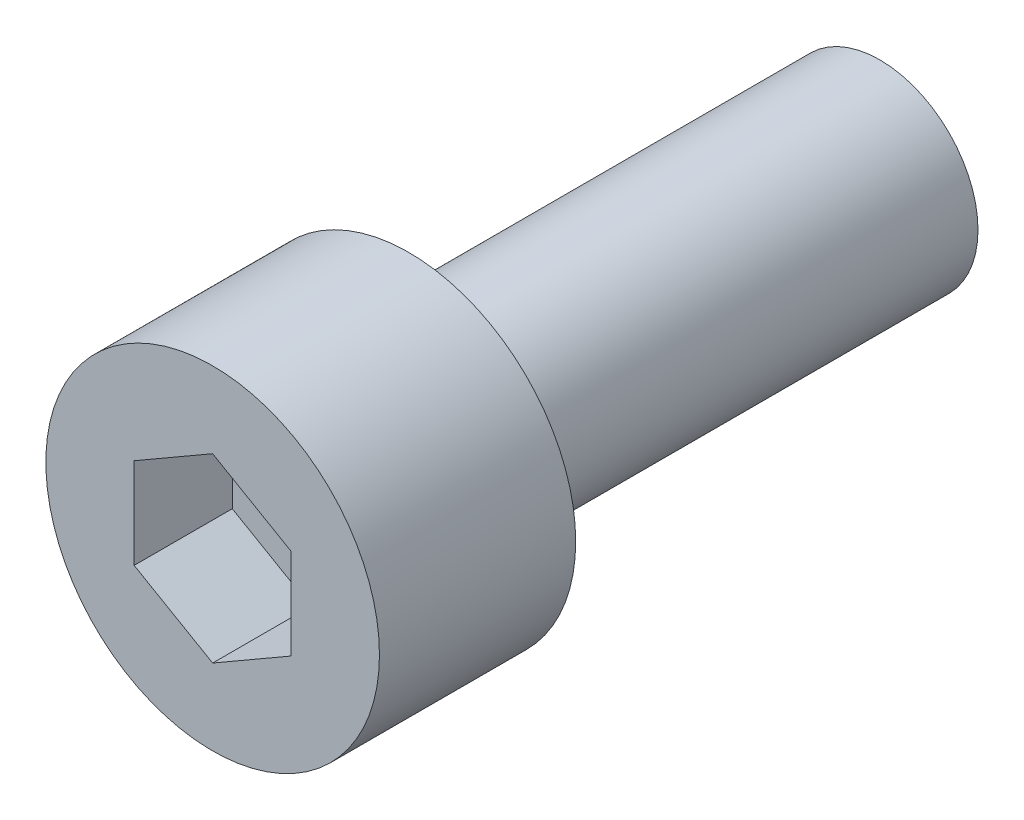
ISO-10303-21;
HEADER;
FILE_DESCRIPTION(('STEP AP214'),'2;1');
FILE_NAME('part.step','',(''),(''),'','','');
FILE_SCHEMA(('AUTOMOTIVE_DESIGN { 1 0 10303 214 1 1 1 1 }'));
ENDSEC;
DATA;
#1=APPLICATION_CONTEXT('core data for automotive mechanical design processes');
#2=APPLICATION_PROTOCOL_DEFINITION('international standard','automotive_design',2000,#1);
#3=PRODUCT_CONTEXT('',#1,'mechanical');
#4=PRODUCT('Part','Part','',(#3));
#5=PRODUCT_RELATED_PRODUCT_CATEGORY('part','',(#4));
#6=PRODUCT_DEFINITION_FORMATION('','',#4);
#7=PRODUCT_DEFINITION_CONTEXT('part definition',#1,'design');
#8=PRODUCT_DEFINITION('design','',#6,#7);
#9=PRODUCT_DEFINITION_SHAPE('','',#8);
#10=(LENGTH_UNIT() NAMED_UNIT(*) SI_UNIT(.MILLI.,.METRE.));
#11=(NAMED_UNIT(*) PLANE_ANGLE_UNIT() SI_UNIT($,.RADIAN.));
#12=(NAMED_UNIT(*) SI_UNIT($,.STERADIAN.) SOLID_ANGLE_UNIT());
#13=UNCERTAINTY_MEASURE_WITH_UNIT(LENGTH_MEASURE(1.E-05),#10,'distance_accuracy_value','');
#14=(GEOMETRIC_REPRESENTATION_CONTEXT(3) GLOBAL_UNCERTAINTY_ASSIGNED_CONTEXT((#13)) GLOBAL_UNIT_ASSIGNED_CONTEXT((#10,
#11,#12)) REPRESENTATION_CONTEXT('',''));
#15=CARTESIAN_POINT('',(0.,0.,0.));
#16=DIRECTION('',(0.,0.,1.));
#17=DIRECTION('',(1.,0.,0.));
#18=AXIS2_PLACEMENT_3D('',#15,#16,#17);
#19=CARTESIAN_POINT('',(2.5,0.,-12.));
#20=DIRECTION('',(0.,0.,-1.));
#21=DIRECTION('',(-1.,0.,0.));
#22=AXIS2_PLACEMENT_3D('',#19,#20,#21);
#23=PLANE('',#22);
#24=CARTESIAN_POINT('',(0.,0.,-12.));
#25=DIRECTION('',(0.,0.,-1.));
#26=DIRECTION('',(-1.,0.,0.));
#27=AXIS2_PLACEMENT_3D('',#24,#25,#26);
#28=CIRCLE('',#27,2.5);
#29=CARTESIAN_POINT('',(-2.5,0.,-12.));
#30=VERTEX_POINT('',#29);
#31=EDGE_CURVE('E11',#30,#30,#28,.T.);
#32=ORIENTED_EDGE('',*,*,#31,.T.);
#33=EDGE_LOOP('',(#32));
#34=FACE_BOUND('',#33,.T.);
#35=ADVANCED_FACE('F17',(#34),#23,.T.);
#36=CARTESIAN_POINT('',(0.,2.3094010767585,2.5));
#37=DIRECTION('',(-0.5,-0.86602540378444,0.));
#38=DIRECTION('',(0.86602540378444,-0.5,0.));
#39=AXIS2_PLACEMENT_3D('',#36,#37,#38);
#40=PLANE('',#39);
#41=DIRECTION('',(0.,0.,1.));
#42=VECTOR('',#41,1.);
#43=CARTESIAN_POINT('',(2.,1.15470053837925,2.5));
#44=LINE('',#43,#42);
#45=CARTESIAN_POINT('',(2.,1.15470053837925,2.5));
#46=VERTEX_POINT('',#45);
#47=CARTESIAN_POINT('',(2.,1.15470053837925,5.));
#48=VERTEX_POINT('',#47);
#49=EDGE_CURVE('E66',#46,#48,#44,.T.);
#50=ORIENTED_EDGE('',*,*,#49,.T.);
#51=DIRECTION('',(0.86602540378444,-0.5,0.));
#52=VECTOR('',#51,1.);
#53=CARTESIAN_POINT('',(0.,2.3094010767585,5.));
#54=LINE('',#53,#52);
#55=CARTESIAN_POINT('',(0.,2.3094010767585,5.));
#56=VERTEX_POINT('',#55);
#57=EDGE_CURVE('E32',#56,#48,#54,.T.);
#58=ORIENTED_EDGE('',*,*,#57,.F.);
#59=DIRECTION('',(0.,0.,1.));
#60=VECTOR('',#59,1.);
#61=CARTESIAN_POINT('',(0.,2.3094010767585,2.5));
#62=LINE('',#61,#60);
#63=CARTESIAN_POINT('',(0.,2.3094010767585,2.5));
#64=VERTEX_POINT('',#63);
#65=EDGE_CURVE('E36',#64,#56,#62,.T.);
#66=ORIENTED_EDGE('',*,*,#65,.F.);
#67=DIRECTION('',(0.86602540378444,-0.5,0.));
#68=VECTOR('',#67,1.);
#69=CARTESIAN_POINT('',(0.,2.3094010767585,2.5));
#70=LINE('',#69,#68);
#71=EDGE_CURVE('E69',#64,#46,#70,.T.);
#72=ORIENTED_EDGE('',*,*,#71,.T.);
#73=EDGE_LOOP('',(#50,#58,#66,#72));
#74=FACE_BOUND('',#73,.T.);
#75=ADVANCED_FACE('F68',(#74),#40,.T.);
#76=CARTESIAN_POINT('',(2.,-1.15470053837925,2.5));
#77=DIRECTION('',(1.,0.,0.));
#78=DIRECTION('',(0.,0.,-1.));
#79=AXIS2_PLACEMENT_3D('',#76,#77,#78);
#80=PLANE('',#79);
#81=DIRECTION('',(0.,0.,1.));
#82=VECTOR('',#81,1.);
#83=CARTESIAN_POINT('',(2.,-1.15470053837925,2.5));
#84=LINE('',#83,#82);
#85=CARTESIAN_POINT('',(2.,-1.15470053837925,2.5));
#86=VERTEX_POINT('',#85);
#87=CARTESIAN_POINT('',(2.,-1.15470053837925,5.));
#88=VERTEX_POINT('',#87);
#89=EDGE_CURVE('E74',#86,#88,#84,.T.);
#90=ORIENTED_EDGE('',*,*,#89,.T.);
#91=DIRECTION('',(0.,1.,0.));
#92=VECTOR('',#91,1.);
#93=CARTESIAN_POINT('',(2.,-1.15470053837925,5.));
#94=LINE('',#93,#92);
#95=EDGE_CURVE('E77',#88,#48,#94,.T.);
#96=ORIENTED_EDGE('',*,*,#95,.T.);
#97=ORIENTED_EDGE('',*,*,#49,.F.);
#98=DIRECTION('',(0.,1.,0.));
#99=VECTOR('',#98,1.);
#100=CARTESIAN_POINT('',(2.,-1.15470053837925,2.5));
#101=LINE('',#100,#99);
#102=EDGE_CURVE('E104',#86,#46,#101,.T.);
#103=ORIENTED_EDGE('',*,*,#102,.F.);
#104=EDGE_LOOP('',(#90,#96,#97,#103));
#105=FACE_BOUND('',#104,.T.);
#106=ADVANCED_FACE('F78',(#105),#80,.F.);
#107=CARTESIAN_POINT('',(0.,-2.3094010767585,2.5));
#108=DIRECTION('',(0.5,-0.86602540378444,0.));
#109=DIRECTION('',(0.86602540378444,0.5,0.));
#110=AXIS2_PLACEMENT_3D('',#107,#108,#109);
#111=PLANE('',#110);
#112=DIRECTION('',(0.,0.,1.));
#113=VECTOR('',#112,1.);
#114=CARTESIAN_POINT('',(0.,-2.3094010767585,2.5));
#115=LINE('',#114,#113);
#116=CARTESIAN_POINT('',(0.,-2.3094010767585,2.5));
#117=VERTEX_POINT('',#116);
#118=CARTESIAN_POINT('',(0.,-2.3094010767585,5.));
#119=VERTEX_POINT('',#118);
#120=EDGE_CURVE('E112',#117,#119,#115,.T.);
#121=ORIENTED_EDGE('',*,*,#120,.T.);
#122=DIRECTION('',(0.86602540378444,0.5,0.));
#123=VECTOR('',#122,1.);
#124=CARTESIAN_POINT('',(0.,-2.3094010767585,5.));
#125=LINE('',#124,#123);
#126=EDGE_CURVE('E82',#119,#88,#125,.T.);
#127=ORIENTED_EDGE('',*,*,#126,.T.);
#128=ORIENTED_EDGE('',*,*,#89,.F.);
#129=DIRECTION('',(0.86602540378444,0.5,0.));
#130=VECTOR('',#129,1.);
#131=CARTESIAN_POINT('',(0.,-2.3094010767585,2.5));
#132=LINE('',#131,#130);
#133=EDGE_CURVE('E101',#117,#86,#132,.T.);
#134=ORIENTED_EDGE('',*,*,#133,.F.);
#135=EDGE_LOOP('',(#121,#127,#128,#134));
#136=FACE_BOUND('',#135,.T.);
#137=ADVANCED_FACE('F213',(#136),#111,.F.);
#138=CARTESIAN_POINT('',(0.,-2.3094010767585,2.5));
#139=DIRECTION('',(0.5,0.86602540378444,0.));
#140=DIRECTION('',(-0.86602540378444,0.5,0.));
#141=AXIS2_PLACEMENT_3D('',#138,#139,#140);
#142=PLANE('',#141);
#143=DIRECTION('',(0.,0.,1.));
#144=VECTOR('',#143,1.);
#145=CARTESIAN_POINT('',(-2.,-1.15470053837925,2.5));
#146=LINE('',#145,#144);
#147=CARTESIAN_POINT('',(-2.,-1.15470053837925,2.5));
#148=VERTEX_POINT('',#147);
#149=CARTESIAN_POINT('',(-2.,-1.15470053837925,5.));
#150=VERTEX_POINT('',#149);
#151=EDGE_CURVE('E110',#148,#150,#146,.T.);
#152=ORIENTED_EDGE('',*,*,#151,.T.);
#153=DIRECTION('',(-0.86602540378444,0.5,0.));
#154=VECTOR('',#153,1.);
#155=CARTESIAN_POINT('',(0.,-2.3094010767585,5.));
#156=LINE('',#155,#154);
#157=EDGE_CURVE('E250',#119,#150,#156,.T.);
#158=ORIENTED_EDGE('',*,*,#157,.F.);
#159=ORIENTED_EDGE('',*,*,#120,.F.);
#160=DIRECTION('',(-0.86602540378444,0.5,0.));
#161=VECTOR('',#160,1.);
#162=CARTESIAN_POINT('',(0.,-2.3094010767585,2.5));
#163=LINE('',#162,#161);
#164=EDGE_CURVE('E98',#117,#148,#163,.T.);
#165=ORIENTED_EDGE('',*,*,#164,.T.);
#166=EDGE_LOOP('',(#152,#158,#159,#165));
#167=FACE_BOUND('',#166,.T.);
#168=ADVANCED_FACE('F203',(#167),#142,.T.);
#169=CARTESIAN_POINT('',(-2.,1.15470053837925,2.5));
#170=DIRECTION('',(-1.,0.,0.));
#171=DIRECTION('',(0.,-1.,0.));
#172=AXIS2_PLACEMENT_3D('',#169,#170,#171);
#173=PLANE('',#172);
#174=DIRECTION('',(0.,0.,1.));
#175=VECTOR('',#174,1.);
#176=CARTESIAN_POINT('',(-2.,1.15470053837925,2.5));
#177=LINE('',#176,#175);
#178=CARTESIAN_POINT('',(-2.,1.15470053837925,2.5));
#179=VERTEX_POINT('',#178);
#180=CARTESIAN_POINT('',(-2.,1.15470053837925,5.));
#181=VERTEX_POINT('',#180);
#182=EDGE_CURVE('E108',#179,#181,#177,.T.);
#183=ORIENTED_EDGE('',*,*,#182,.T.);
#184=DIRECTION('',(0.,-1.,0.));
#185=VECTOR('',#184,1.);
#186=CARTESIAN_POINT('',(-2.,1.15470053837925,5.));
#187=LINE('',#186,#185);
#188=EDGE_CURVE('E252',#181,#150,#187,.T.);
#189=ORIENTED_EDGE('',*,*,#188,.T.);
#190=ORIENTED_EDGE('',*,*,#151,.F.);
#191=DIRECTION('',(0.,-1.,0.));
#192=VECTOR('',#191,1.);
#193=CARTESIAN_POINT('',(-2.,1.15470053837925,2.5));
#194=LINE('',#193,#192);
#195=EDGE_CURVE('E95',#179,#148,#194,.T.);
#196=ORIENTED_EDGE('',*,*,#195,.F.);
#197=EDGE_LOOP('',(#183,#189,#190,#196));
#198=FACE_BOUND('',#197,.T.);
#199=ADVANCED_FACE('F186',(#198),#173,.F.);
#200=CARTESIAN_POINT('',(0.,2.3094010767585,2.5));
#201=DIRECTION('',(-0.5,0.86602540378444,0.));
#202=DIRECTION('',(-0.86602540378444,-0.5,0.));
#203=AXIS2_PLACEMENT_3D('',#200,#201,#202);
#204=PLANE('',#203);
#205=DIRECTION('',(-0.86602540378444,-0.5,0.));
#206=VECTOR('',#205,1.);
#207=CARTESIAN_POINT('',(0.,2.3094010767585,2.5));
#208=LINE('',#207,#206);
#209=EDGE_CURVE('E92',#64,#179,#208,.T.);
#210=ORIENTED_EDGE('',*,*,#209,.F.);
#211=ORIENTED_EDGE('',*,*,#65,.T.);
#212=DIRECTION('',(-0.86602540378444,-0.5,0.));
#213=VECTOR('',#212,1.);
#214=CARTESIAN_POINT('',(0.,2.3094010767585,5.));
#215=LINE('',#214,#213);
#216=EDGE_CURVE('E88',#56,#181,#215,.T.);
#217=ORIENTED_EDGE('',*,*,#216,.T.);
#218=ORIENTED_EDGE('',*,*,#182,.F.);
#219=EDGE_LOOP('',(#210,#211,#217,#218));
#220=FACE_BOUND('',#219,.T.);
#221=ADVANCED_FACE('F138',(#220),#204,.F.);
#222=CARTESIAN_POINT('',(-2.,3.46410161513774,2.5));
#223=DIRECTION('',(0.,0.,-1.));
#224=DIRECTION('',(-1.,0.,0.));
#225=AXIS2_PLACEMENT_3D('',#222,#223,#224);
#226=PLANE('',#225);
#227=ORIENTED_EDGE('',*,*,#71,.F.);
#228=ORIENTED_EDGE('',*,*,#209,.T.);
#229=ORIENTED_EDGE('',*,*,#195,.T.);
#230=ORIENTED_EDGE('',*,*,#164,.F.);
#231=ORIENTED_EDGE('',*,*,#133,.T.);
#232=ORIENTED_EDGE('',*,*,#102,.T.);
#233=EDGE_LOOP('',(#227,#228,#229,#230,#231,#232));
#234=FACE_BOUND('',#233,.T.);
#235=ADVANCED_FACE('F136',(#234),#226,.F.);
#236=CARTESIAN_POINT('',(0.,0.,5.));
#237=DIRECTION('',(0.,0.,1.));
#238=DIRECTION('',(1.,0.,0.));
#239=AXIS2_PLACEMENT_3D('',#236,#237,#238);
#240=PLANE('',#239);
#241=CARTESIAN_POINT('',(0.,0.,5.));
#242=DIRECTION('',(0.,0.,1.));
#243=DIRECTION('',(1.,0.,0.));
#244=AXIS2_PLACEMENT_3D('',#241,#242,#243);
#245=CIRCLE('',#244,4.25);
#246=CARTESIAN_POINT('',(4.25,0.,5.));
#247=VERTEX_POINT('',#246);
#248=EDGE_CURVE('E25',#247,#247,#245,.T.);
#249=ORIENTED_EDGE('',*,*,#248,.T.);
#250=EDGE_LOOP('',(#249));
#251=FACE_BOUND('',#250,.T.);
#252=ORIENTED_EDGE('',*,*,#216,.F.);
#253=ORIENTED_EDGE('',*,*,#57,.T.);
#254=ORIENTED_EDGE('',*,*,#95,.F.);
#255=ORIENTED_EDGE('',*,*,#126,.F.);
#256=ORIENTED_EDGE('',*,*,#157,.T.);
#257=ORIENTED_EDGE('',*,*,#188,.F.);
#258=EDGE_LOOP('',(#252,#253,#254,#255,#256,#257));
#259=FACE_BOUND('',#258,.T.);
#260=ADVANCED_FACE('F85',(#251,#259),#240,.T.);
#261=CARTESIAN_POINT('',(0.,0.,8.));
#262=DIRECTION('',(0.,0.,1.));
#263=DIRECTION('',(1.,0.,0.));
#264=AXIS2_PLACEMENT_3D('',#261,#262,#263);
#265=CYLINDRICAL_SURFACE('',#264,4.25);
#266=CARTESIAN_POINT('',(0.,0.,0.));
#267=DIRECTION('',(0.,0.,1.));
#268=DIRECTION('',(1.,0.,0.));
#269=AXIS2_PLACEMENT_3D('',#266,#267,#268);
#270=CIRCLE('',#269,4.25);
#271=CARTESIAN_POINT('',(4.25,0.,0.));
#272=VERTEX_POINT('',#271);
#273=EDGE_CURVE('E117',#272,#272,#270,.T.);
#274=ORIENTED_EDGE('',*,*,#273,.T.);
#275=EDGE_LOOP('',(#274));
#276=FACE_BOUND('',#275,.T.);
#277=ORIENTED_EDGE('',*,*,#248,.F.);
#278=EDGE_LOOP('',(#277));
#279=FACE_BOUND('',#278,.T.);
#280=ADVANCED_FACE('F123',(#276,#279),#265,.T.);
#281=CARTESIAN_POINT('',(4.25,0.,0.));
#282=DIRECTION('',(0.,0.,-1.));
#283=DIRECTION('',(-1.,0.,0.));
#284=AXIS2_PLACEMENT_3D('',#281,#282,#283);
#285=PLANE('',#284);
#286=CARTESIAN_POINT('',(0.,0.,0.));
#287=DIRECTION('',(0.,0.,1.));
#288=DIRECTION('',(1.,0.,0.));
#289=AXIS2_PLACEMENT_3D('',#286,#287,#288);
#290=CIRCLE('',#289,2.5);
#291=CARTESIAN_POINT('',(2.5,0.,0.));
#292=VERTEX_POINT('',#291);
#293=EDGE_CURVE('E73',#292,#292,#290,.T.);
#294=ORIENTED_EDGE('',*,*,#293,.T.);
#295=EDGE_LOOP('',(#294));
#296=FACE_BOUND('',#295,.T.);
#297=ORIENTED_EDGE('',*,*,#273,.F.);
#298=EDGE_LOOP('',(#297));
#299=FACE_BOUND('',#298,.T.);
#300=ADVANCED_FACE('F125',(#296,#299),#285,.T.);
#301=CARTESIAN_POINT('',(0.,0.,8.));
#302=DIRECTION('',(0.,0.,1.));
#303=DIRECTION('',(1.,0.,0.));
#304=AXIS2_PLACEMENT_3D('',#301,#302,#303);
#305=CYLINDRICAL_SURFACE('',#304,2.5);
#306=ORIENTED_EDGE('',*,*,#31,.F.);
#307=EDGE_LOOP('',(#306));
#308=FACE_BOUND('',#307,.T.);
#309=ORIENTED_EDGE('',*,*,#293,.F.);
#310=EDGE_LOOP('',(#309));
#311=FACE_BOUND('',#310,.T.);
#312=ADVANCED_FACE('F19',(#308,#311),#305,.T.);
#313=CLOSED_SHELL('',(#35,#75,#106,#137,#168,#199,#221,#235,#260,#280,#300,#312));
#314=MANIFOLD_SOLID_BREP('B1',#313);
#315=ADVANCED_BREP_SHAPE_REPRESENTATION('',(#18,#314),#14);
#316=SHAPE_DEFINITION_REPRESENTATION(#9,#315);
ENDSEC;
END-ISO-10303-21;
